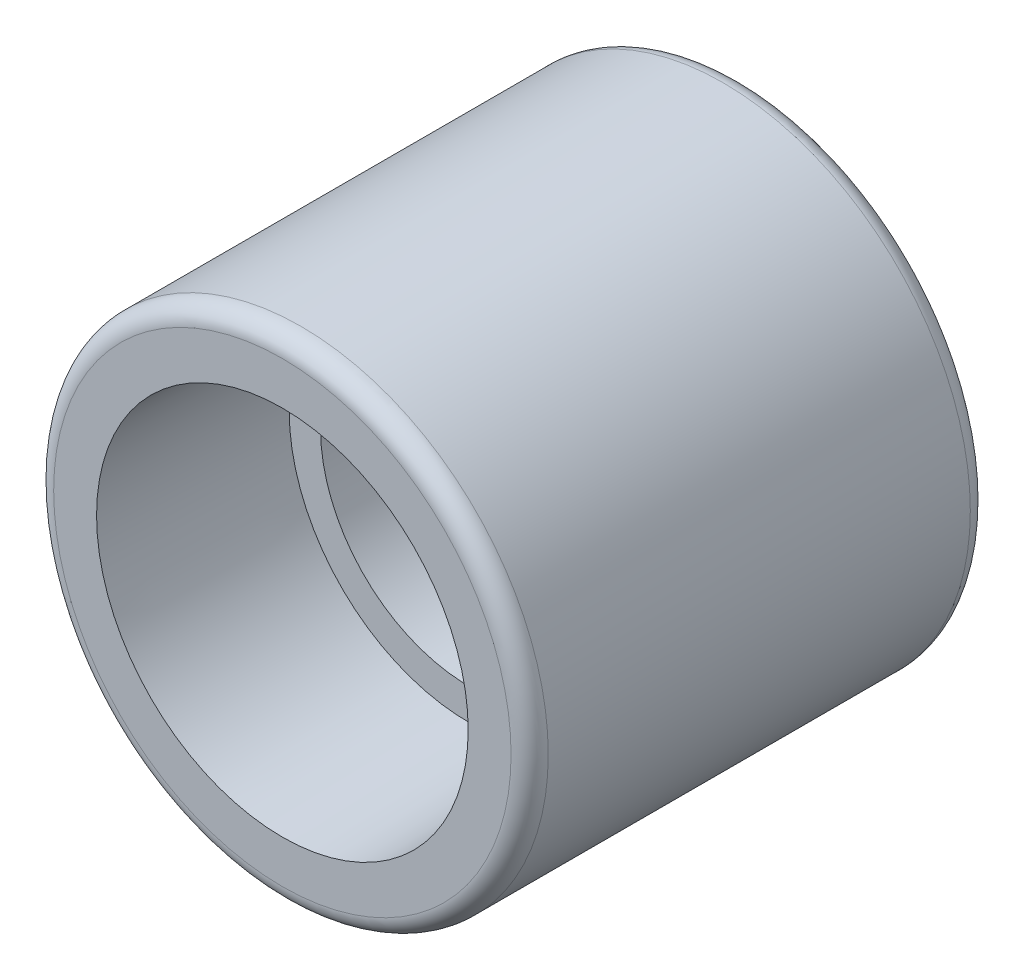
ISO-10303-21;
HEADER;
FILE_DESCRIPTION(('STEP AP214'),'2;1');
FILE_NAME('part.step','',(''),(''),'','','');
FILE_SCHEMA(('AUTOMOTIVE_DESIGN { 1 0 10303 214 1 1 1 1 }'));
ENDSEC;
DATA;
#1=APPLICATION_CONTEXT('core data for automotive mechanical design processes');
#2=APPLICATION_PROTOCOL_DEFINITION('international standard','automotive_design',2000,#1);
#3=PRODUCT_CONTEXT('',#1,'mechanical');
#4=PRODUCT('Part','Part','',(#3));
#5=PRODUCT_RELATED_PRODUCT_CATEGORY('part','',(#4));
#6=PRODUCT_DEFINITION_FORMATION('','',#4);
#7=PRODUCT_DEFINITION_CONTEXT('part definition',#1,'design');
#8=PRODUCT_DEFINITION('design','',#6,#7);
#9=PRODUCT_DEFINITION_SHAPE('','',#8);
#10=(LENGTH_UNIT() NAMED_UNIT(*) SI_UNIT(.MILLI.,.METRE.));
#11=(NAMED_UNIT(*) PLANE_ANGLE_UNIT() SI_UNIT($,.RADIAN.));
#12=(NAMED_UNIT(*) SI_UNIT($,.STERADIAN.) SOLID_ANGLE_UNIT());
#13=UNCERTAINTY_MEASURE_WITH_UNIT(LENGTH_MEASURE(1.E-05),#10,'distance_accuracy_value','');
#14=(GEOMETRIC_REPRESENTATION_CONTEXT(3) GLOBAL_UNCERTAINTY_ASSIGNED_CONTEXT((#13)) GLOBAL_UNIT_ASSIGNED_CONTEXT((#10,
#11,#12)) REPRESENTATION_CONTEXT('',''));
#15=CARTESIAN_POINT('',(0.,0.,0.));
#16=DIRECTION('',(0.,0.,1.));
#17=DIRECTION('',(1.,0.,0.));
#18=AXIS2_PLACEMENT_3D('',#15,#16,#17);
#19=CARTESIAN_POINT('',(0.,0.,41.275));
#20=DIRECTION('',(0.,0.,-1.));
#21=DIRECTION('',(-1.,0.,0.));
#22=AXIS2_PLACEMENT_3D('',#19,#20,#21);
#23=CYLINDRICAL_SURFACE('',#22,22.225);
#24=CARTESIAN_POINT('',(0.,0.,39.60495));
#25=DIRECTION('',(0.,0.,1.));
#26=DIRECTION('',(1.,0.,0.));
#27=AXIS2_PLACEMENT_3D('',#24,#25,#26);
#28=CIRCLE('',#27,22.225);
#29=CARTESIAN_POINT('',(22.225,0.,39.60495));
#30=VERTEX_POINT('',#29);
#31=EDGE_CURVE('E39',#30,#30,#28,.F.);
#32=ORIENTED_EDGE('',*,*,#31,.T.);
#33=EDGE_LOOP('',(#32));
#34=FACE_BOUND('',#33,.T.);
#35=CARTESIAN_POINT('',(0.,0.,1.67005));
#36=DIRECTION('',(0.,0.,1.));
#37=DIRECTION('',(1.,0.,0.));
#38=AXIS2_PLACEMENT_3D('',#35,#36,#37);
#39=CIRCLE('',#38,22.225);
#40=CARTESIAN_POINT('',(22.225,0.,1.67005));
#41=VERTEX_POINT('',#40);
#42=EDGE_CURVE('E43',#41,#41,#39,.T.);
#43=ORIENTED_EDGE('',*,*,#42,.T.);
#44=EDGE_LOOP('',(#43));
#45=FACE_BOUND('',#44,.T.);
#46=ADVANCED_FACE('F32',(#34,#45),#23,.T.);
#47=CARTESIAN_POINT('',(0.,0.,41.275));
#48=DIRECTION('',(0.,0.,1.));
#49=DIRECTION('',(1.,0.,0.));
#50=AXIS2_PLACEMENT_3D('',#47,#48,#49);
#51=PLANE('',#50);
#52=CARTESIAN_POINT('',(0.,0.,41.275));
#53=DIRECTION('',(0.,0.,1.));
#54=DIRECTION('',(1.,0.,0.));
#55=AXIS2_PLACEMENT_3D('',#52,#53,#54);
#56=CIRCLE('',#55,20.55495);
#57=CARTESIAN_POINT('',(20.55495,0.,41.275));
#58=VERTEX_POINT('',#57);
#59=EDGE_CURVE('E47',#58,#58,#56,.T.);
#60=ORIENTED_EDGE('',*,*,#59,.T.);
#61=EDGE_LOOP('',(#60));
#62=FACE_BOUND('',#61,.T.);
#63=CARTESIAN_POINT('',(0.,0.,41.275));
#64=DIRECTION('',(0.,0.,-1.));
#65=DIRECTION('',(-1.,0.,0.));
#66=AXIS2_PLACEMENT_3D('',#63,#64,#65);
#67=CIRCLE('',#66,16.7005);
#68=CARTESIAN_POINT('',(-16.7005,0.,41.275));
#69=VERTEX_POINT('',#68);
#70=EDGE_CURVE('E61',#69,#69,#67,.T.);
#71=ORIENTED_EDGE('',*,*,#70,.T.);
#72=EDGE_LOOP('',(#71));
#73=FACE_BOUND('',#72,.T.);
#74=ADVANCED_FACE('F65',(#62,#73),#51,.T.);
#75=CARTESIAN_POINT('',(0.,0.,0.));
#76=DIRECTION('',(0.,0.,1.));
#77=DIRECTION('',(1.,0.,0.));
#78=AXIS2_PLACEMENT_3D('',#75,#76,#77);
#79=PLANE('',#78);
#80=CARTESIAN_POINT('',(0.,0.,0.));
#81=DIRECTION('',(0.,0.,1.));
#82=DIRECTION('',(1.,0.,0.));
#83=AXIS2_PLACEMENT_3D('',#80,#81,#82);
#84=CIRCLE('',#83,20.55495);
#85=CARTESIAN_POINT('',(20.55495,0.,0.));
#86=VERTEX_POINT('',#85);
#87=EDGE_CURVE('E10',#86,#86,#84,.F.);
#88=ORIENTED_EDGE('',*,*,#87,.T.);
#89=EDGE_LOOP('',(#88));
#90=FACE_BOUND('',#89,.T.);
#91=ADVANCED_FACE('F77',(#90),#79,.F.);
#92=CARTESIAN_POINT('',(0.,0.,24.4856));
#93=DIRECTION('',(0.,0.,-1.));
#94=DIRECTION('',(-1.,0.,0.));
#95=AXIS2_PLACEMENT_3D('',#92,#93,#94);
#96=PLANE('',#95);
#97=CARTESIAN_POINT('',(0.,0.,24.4856));
#98=DIRECTION('',(0.,0.,-1.));
#99=DIRECTION('',(-1.,0.,0.));
#100=AXIS2_PLACEMENT_3D('',#97,#98,#99);
#101=CIRCLE('',#100,16.1777604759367);
#102=CARTESIAN_POINT('',(-16.1777604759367,0.,24.4856));
#103=VERTEX_POINT('',#102);
#104=EDGE_CURVE('E56',#103,#103,#101,.T.);
#105=ORIENTED_EDGE('',*,*,#104,.F.);
#106=EDGE_LOOP('',(#105));
#107=FACE_BOUND('',#106,.T.);
#108=CARTESIAN_POINT('',(0.,0.,24.4856));
#109=DIRECTION('',(0.,0.,-1.));
#110=DIRECTION('',(-1.,0.,0.));
#111=AXIS2_PLACEMENT_3D('',#108,#109,#110);
#112=CIRCLE('',#111,13.3604);
#113=CARTESIAN_POINT('',(-13.3604,0.,24.4856));
#114=VERTEX_POINT('',#113);
#115=EDGE_CURVE('E53',#114,#114,#112,.F.);
#116=ORIENTED_EDGE('',*,*,#115,.F.);
#117=EDGE_LOOP('',(#116));
#118=FACE_BOUND('',#117,.T.);
#119=ADVANCED_FACE('F71',(#107,#118),#96,.F.);
#120=CARTESIAN_POINT('',(0.,0.,24.4856));
#121=DIRECTION('',(0.,0.,1.));
#122=DIRECTION('',(1.,0.,0.));
#123=AXIS2_PLACEMENT_3D('',#120,#121,#122);
#124=CONICAL_SURFACE('',#123,16.1777604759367,0.0311250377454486);
#125=ORIENTED_EDGE('',*,*,#70,.F.);
#126=EDGE_LOOP('',(#125));
#127=FACE_BOUND('',#126,.T.);
#128=ORIENTED_EDGE('',*,*,#104,.T.);
#129=EDGE_LOOP('',(#128));
#130=FACE_BOUND('',#129,.T.);
#131=ADVANCED_FACE('F67',(#127,#130),#124,.F.);
#132=CARTESIAN_POINT('',(0.,0.,9.525));
#133=DIRECTION('',(0.,0.,1.));
#134=DIRECTION('',(1.,0.,0.));
#135=AXIS2_PLACEMENT_3D('',#132,#133,#134);
#136=PLANE('',#135);
#137=CARTESIAN_POINT('',(0.,0.,9.525));
#138=DIRECTION('',(0.,0.,1.));
#139=DIRECTION('',(1.,0.,0.));
#140=AXIS2_PLACEMENT_3D('',#137,#138,#139);
#141=CIRCLE('',#140,13.3604);
#142=CARTESIAN_POINT('',(13.3604,0.,9.525));
#143=VERTEX_POINT('',#142);
#144=EDGE_CURVE('E52',#143,#143,#141,.T.);
#145=ORIENTED_EDGE('',*,*,#144,.T.);
#146=EDGE_LOOP('',(#145));
#147=FACE_BOUND('',#146,.T.);
#148=ADVANCED_FACE('F70',(#147),#136,.T.);
#149=CARTESIAN_POINT('',(0.,0.,9.525));
#150=DIRECTION('',(0.,0.,1.));
#151=DIRECTION('',(1.,0.,0.));
#152=AXIS2_PLACEMENT_3D('',#149,#150,#151);
#153=CYLINDRICAL_SURFACE('',#152,13.3604);
#154=ORIENTED_EDGE('',*,*,#115,.T.);
#155=EDGE_LOOP('',(#154));
#156=FACE_BOUND('',#155,.T.);
#157=ORIENTED_EDGE('',*,*,#144,.F.);
#158=EDGE_LOOP('',(#157));
#159=FACE_BOUND('',#158,.T.);
#160=ADVANCED_FACE('F81',(#156,#159),#153,.F.);
#161=CARTESIAN_POINT('',(0.,0.,39.60495));
#162=DIRECTION('',(0.,0.,1.));
#163=DIRECTION('',(1.,0.,0.));
#164=AXIS2_PLACEMENT_3D('',#161,#162,#163);
#165=TOROIDAL_SURFACE('',#164,20.55495,1.67005);
#166=ORIENTED_EDGE('',*,*,#31,.F.);
#167=EDGE_LOOP('',(#166));
#168=FACE_BOUND('',#167,.T.);
#169=ORIENTED_EDGE('',*,*,#59,.F.);
#170=EDGE_LOOP('',(#169));
#171=FACE_BOUND('',#170,.T.);
#172=ADVANCED_FACE('F84',(#168,#171),#165,.T.);
#173=CARTESIAN_POINT('',(0.,0.,1.67005));
#174=DIRECTION('',(0.,0.,1.));
#175=DIRECTION('',(1.,0.,0.));
#176=AXIS2_PLACEMENT_3D('',#173,#174,#175);
#177=TOROIDAL_SURFACE('',#176,20.55495,1.67005);
#178=ORIENTED_EDGE('',*,*,#87,.F.);
#179=EDGE_LOOP('',(#178));
#180=FACE_BOUND('',#179,.T.);
#181=ORIENTED_EDGE('',*,*,#42,.F.);
#182=EDGE_LOOP('',(#181));
#183=FACE_BOUND('',#182,.T.);
#184=ADVANCED_FACE('F34',(#180,#183),#177,.T.);
#185=CLOSED_SHELL('',(#46,#74,#91,#119,#131,#148,#160,#172,#184));
#186=MANIFOLD_SOLID_BREP('B2',#185);
#187=ADVANCED_BREP_SHAPE_REPRESENTATION('',(#18,#186),#14);
#188=SHAPE_DEFINITION_REPRESENTATION(#9,#187);
ENDSEC;
END-ISO-10303-21;
